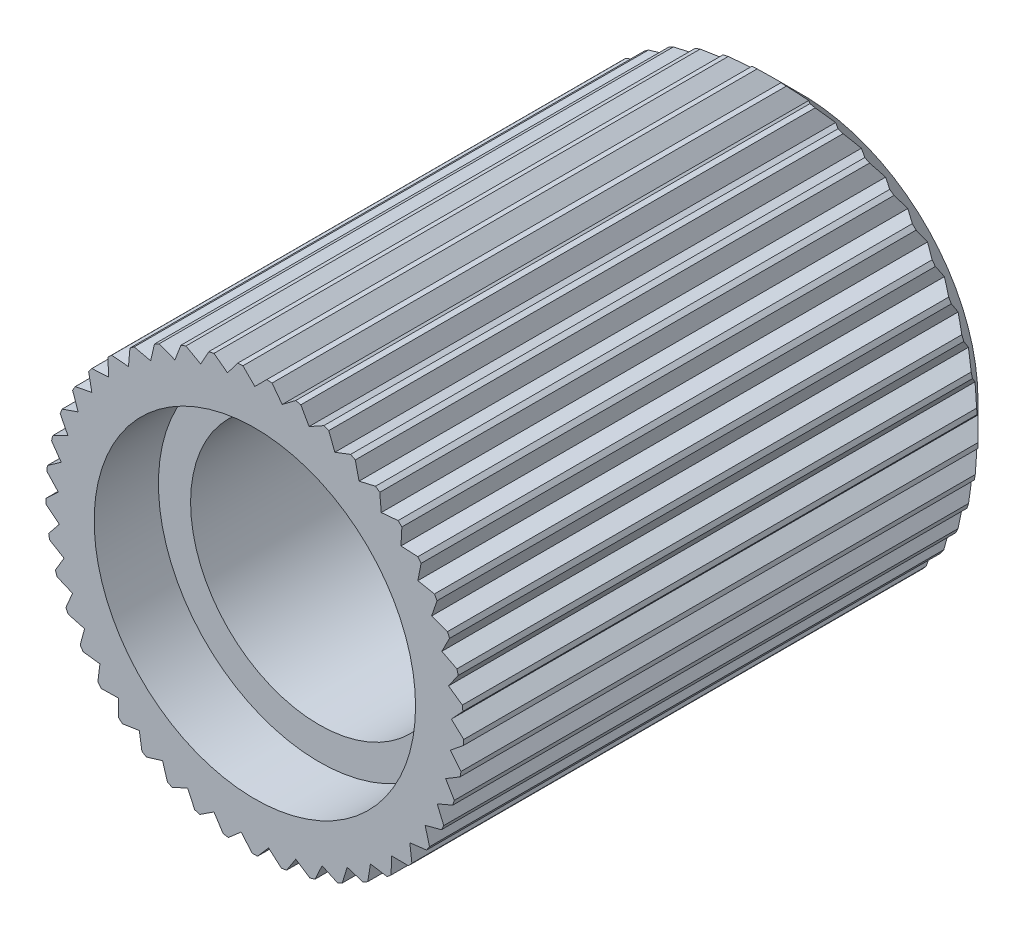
from build123d import *

# Parameters (mm, degrees)
ESQUISSE1_R                  = 6.5
ESQUISSE1_R_2                = 4
EXTRUSION1_DEPTH             = 17
ESQUISSE2_R                  = 5
ENL_V_MAT_EXTRU_1_DEPTH      = 3
ENL_V_START                  = -2
ESQUISSE3_R                  = 5
ENL_V_MAT_EXTRU_2_DEPTH      = 2
CHANFREIN1_SIZE              = 1
ENL_V_MAT_EXTRU_3_DEPTH      = 20.32614809
R_P_TITION_CIRCULAIRE1_COUNT = 45


with BuildPart() as part:
    # Esquisse1 → Extrusion1 (new body)
    with BuildSketch(Plane.XY):
        Circle(ESQUISSE1_R)
        Circle(ESQUISSE1_R_2, mode=Mode.SUBTRACT)
    extrude(amount=EXTRUSION1_DEPTH)

    # Esquisse2 → Enl_v. mat.-Extru.1 (cut)
    with BuildSketch(Plane(origin=(0, 0, 0), x_dir=(-1, 0, 0), z_dir=(0, 0, -1))):
        Circle(ESQUISSE2_R)
    extrude(amount=-ENL_V_MAT_EXTRU_1_DEPTH, mode=Mode.SUBTRACT)

    # Esquisse3 → Enl_v. mat.-Extru.2 (cut)
    with BuildSketch(Plane.XY.offset(17).offset(ENL_V_START)):
        with Locations(Location((0, 0, 0), (0, 0, 180))):
            Circle(ESQUISSE3_R)
    extrude(amount=ENL_V_MAT_EXTRU_2_DEPTH, mode=Mode.SUBTRACT)

    # Chanfrein1
    chanfrein1_edges = [part.edges().sort_by_distance(p)[0] for p in [
        (-6.5, 0, 0),
    ]]
    chamfer(chanfrein1_edges, length=CHANFREIN1_SIZE)

    # Esquisse4 → Enl_v. mat.-Extru.3 (cut, symmetric)
    with BuildSketch(Plane.XY.offset(17)):
        Polygon((-28.224332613, 34.342223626), (-0.371484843, 6.489375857), (0, 6.117891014), (0.371484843, 6.489375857), (28.224332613, 34.342223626), (28.224332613, 113.121973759), (-28.224332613, 113.121973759), align=None)
    enl_v_mat_extru_3 = extrude(amount=ENL_V_MAT_EXTRU_3_DEPTH, both=True, mode=Mode.SUBTRACT)

    # R_p_tition circulaire1: Enl_v. mat.-Extru.3 ×45 about axis
    r_p_tition_circulaire1_axis = Axis((0, 0, 17), (0, 0, -1))
    for i in range(1, R_P_TITION_CIRCULAIRE1_COUNT):
        add(enl_v_mat_extru_3.rotate(r_p_tition_circulaire1_axis, i * 360 / R_P_TITION_CIRCULAIRE1_COUNT), mode=Mode.SUBTRACT)


solid = part.part
